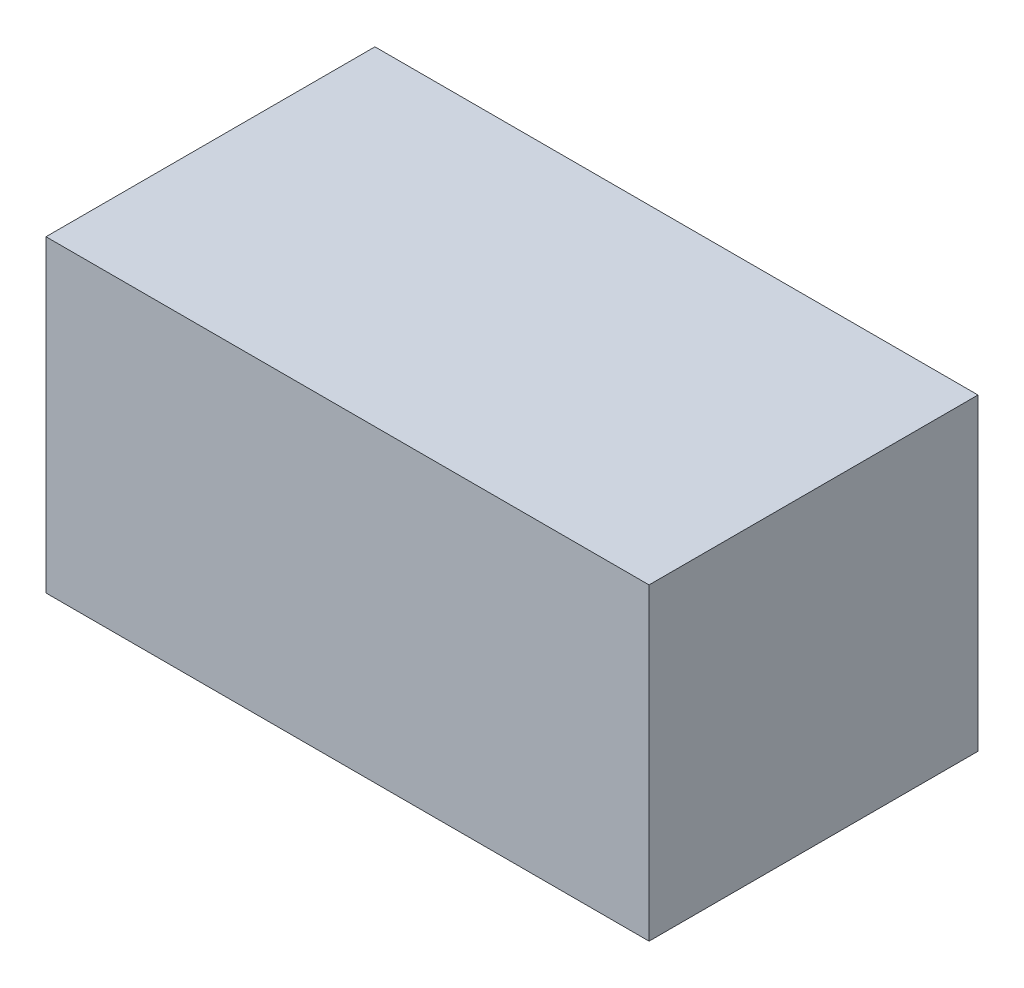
ISO-10303-21;
HEADER;
FILE_DESCRIPTION(('STEP AP214'),'2;1');
FILE_NAME('part.step','',(''),(''),'','','');
FILE_SCHEMA(('AUTOMOTIVE_DESIGN { 1 0 10303 214 1 1 1 1 }'));
ENDSEC;
DATA;
#1=APPLICATION_CONTEXT('core data for automotive mechanical design processes');
#2=APPLICATION_PROTOCOL_DEFINITION('international standard','automotive_design',2000,#1);
#3=PRODUCT_CONTEXT('',#1,'mechanical');
#4=PRODUCT('Part','Part','',(#3));
#5=PRODUCT_RELATED_PRODUCT_CATEGORY('part','',(#4));
#6=PRODUCT_DEFINITION_FORMATION('','',#4);
#7=PRODUCT_DEFINITION_CONTEXT('part definition',#1,'design');
#8=PRODUCT_DEFINITION('design','',#6,#7);
#9=PRODUCT_DEFINITION_SHAPE('','',#8);
#10=(LENGTH_UNIT() NAMED_UNIT(*) SI_UNIT(.MILLI.,.METRE.));
#11=(NAMED_UNIT(*) PLANE_ANGLE_UNIT() SI_UNIT($,.RADIAN.));
#12=(NAMED_UNIT(*) SI_UNIT($,.STERADIAN.) SOLID_ANGLE_UNIT());
#13=UNCERTAINTY_MEASURE_WITH_UNIT(LENGTH_MEASURE(1.E-05),#10,'distance_accuracy_value','');
#14=(GEOMETRIC_REPRESENTATION_CONTEXT(3) GLOBAL_UNCERTAINTY_ASSIGNED_CONTEXT((#13)) GLOBAL_UNIT_ASSIGNED_CONTEXT((#10,
#11,#12)) REPRESENTATION_CONTEXT('',''));
#15=CARTESIAN_POINT('',(0.,0.,0.));
#16=DIRECTION('',(0.,0.,1.));
#17=DIRECTION('',(1.,0.,0.));
#18=AXIS2_PLACEMENT_3D('',#15,#16,#17);
#19=CARTESIAN_POINT('',(-55.,0.,30.));
#20=DIRECTION('',(1.,0.,0.));
#21=DIRECTION('',(0.,0.,-1.));
#22=AXIS2_PLACEMENT_3D('',#19,#20,#21);
#23=PLANE('',#22);
#24=DIRECTION('',(0.,-1.,0.));
#25=VECTOR('',#24,1.);
#26=CARTESIAN_POINT('',(-55.,0.,-30.));
#27=LINE('',#26,#25);
#28=CARTESIAN_POINT('',(-55.,56.283128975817,-30.));
#29=VERTEX_POINT('',#28);
#30=CARTESIAN_POINT('',(-55.,0.,-30.));
#31=VERTEX_POINT('',#30);
#32=EDGE_CURVE('E95',#29,#31,#27,.T.);
#33=ORIENTED_EDGE('',*,*,#32,.T.);
#34=DIRECTION('',(0.,0.,-1.));
#35=VECTOR('',#34,1.);
#36=CARTESIAN_POINT('',(-55.,0.,30.));
#37=LINE('',#36,#35);
#38=CARTESIAN_POINT('',(-55.,0.,30.));
#39=VERTEX_POINT('',#38);
#40=EDGE_CURVE('E11',#39,#31,#37,.T.);
#41=ORIENTED_EDGE('',*,*,#40,.F.);
#42=DIRECTION('',(0.,-1.,0.));
#43=VECTOR('',#42,1.);
#44=CARTESIAN_POINT('',(-55.,0.,30.));
#45=LINE('',#44,#43);
#46=CARTESIAN_POINT('',(-55.,56.283128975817,30.));
#47=VERTEX_POINT('',#46);
#48=EDGE_CURVE('E83',#47,#39,#45,.T.);
#49=ORIENTED_EDGE('',*,*,#48,.F.);
#50=DIRECTION('',(0.,0.,-1.));
#51=VECTOR('',#50,1.);
#52=CARTESIAN_POINT('',(-55.,56.283128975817,30.));
#53=LINE('',#52,#51);
#54=EDGE_CURVE('E91',#47,#29,#53,.T.);
#55=ORIENTED_EDGE('',*,*,#54,.T.);
#56=EDGE_LOOP('',(#33,#41,#49,#55));
#57=FACE_BOUND('',#56,.T.);
#58=ADVANCED_FACE('F32',(#57),#23,.F.);
#59=CARTESIAN_POINT('',(55.,0.,30.));
#60=DIRECTION('',(0.,1.,0.));
#61=DIRECTION('',(0.,0.,1.));
#62=AXIS2_PLACEMENT_3D('',#59,#60,#61);
#63=PLANE('',#62);
#64=DIRECTION('',(1.,0.,0.));
#65=VECTOR('',#64,1.);
#66=CARTESIAN_POINT('',(55.,0.,-30.));
#67=LINE('',#66,#65);
#68=CARTESIAN_POINT('',(55.,0.,-30.));
#69=VERTEX_POINT('',#68);
#70=EDGE_CURVE('E87',#31,#69,#67,.T.);
#71=ORIENTED_EDGE('',*,*,#70,.T.);
#72=DIRECTION('',(0.,0.,-1.));
#73=VECTOR('',#72,1.);
#74=CARTESIAN_POINT('',(55.,0.,30.));
#75=LINE('',#74,#73);
#76=CARTESIAN_POINT('',(55.,0.,30.));
#77=VERTEX_POINT('',#76);
#78=EDGE_CURVE('E40',#77,#69,#75,.T.);
#79=ORIENTED_EDGE('',*,*,#78,.F.);
#80=DIRECTION('',(1.,0.,0.));
#81=VECTOR('',#80,1.);
#82=CARTESIAN_POINT('',(55.,0.,30.));
#83=LINE('',#82,#81);
#84=EDGE_CURVE('E78',#39,#77,#83,.T.);
#85=ORIENTED_EDGE('',*,*,#84,.F.);
#86=ORIENTED_EDGE('',*,*,#40,.T.);
#87=EDGE_LOOP('',(#71,#79,#85,#86));
#88=FACE_BOUND('',#87,.T.);
#89=ADVANCED_FACE('F86',(#88),#63,.F.);
#90=CARTESIAN_POINT('',(55.,0.,30.));
#91=DIRECTION('',(-1.,0.,0.));
#92=DIRECTION('',(0.,0.,1.));
#93=AXIS2_PLACEMENT_3D('',#90,#91,#92);
#94=PLANE('',#93);
#95=DIRECTION('',(0.,1.,0.));
#96=VECTOR('',#95,1.);
#97=CARTESIAN_POINT('',(55.,0.,-30.));
#98=LINE('',#97,#96);
#99=CARTESIAN_POINT('',(55.,56.283128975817,-30.));
#100=VERTEX_POINT('',#99);
#101=EDGE_CURVE('E65',#69,#100,#98,.T.);
#102=ORIENTED_EDGE('',*,*,#101,.T.);
#103=DIRECTION('',(0.,0.,-1.));
#104=VECTOR('',#103,1.);
#105=CARTESIAN_POINT('',(55.,56.283128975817,30.));
#106=LINE('',#105,#104);
#107=CARTESIAN_POINT('',(55.,56.283128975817,30.));
#108=VERTEX_POINT('',#107);
#109=EDGE_CURVE('E88',#108,#100,#106,.T.);
#110=ORIENTED_EDGE('',*,*,#109,.F.);
#111=DIRECTION('',(0.,1.,0.));
#112=VECTOR('',#111,1.);
#113=CARTESIAN_POINT('',(55.,0.,30.));
#114=LINE('',#113,#112);
#115=EDGE_CURVE('E81',#77,#108,#114,.T.);
#116=ORIENTED_EDGE('',*,*,#115,.F.);
#117=ORIENTED_EDGE('',*,*,#78,.T.);
#118=EDGE_LOOP('',(#102,#110,#116,#117));
#119=FACE_BOUND('',#118,.T.);
#120=ADVANCED_FACE('F89',(#119),#94,.F.);
#121=CARTESIAN_POINT('',(-55.,56.283128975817,30.));
#122=DIRECTION('',(0.,-1.,0.));
#123=DIRECTION('',(0.,0.,-1.));
#124=AXIS2_PLACEMENT_3D('',#121,#122,#123);
#125=PLANE('',#124);
#126=DIRECTION('',(-1.,0.,0.));
#127=VECTOR('',#126,1.);
#128=CARTESIAN_POINT('',(-55.,56.283128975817,-30.));
#129=LINE('',#128,#127);
#130=EDGE_CURVE('E71',#100,#29,#129,.T.);
#131=ORIENTED_EDGE('',*,*,#130,.T.);
#132=ORIENTED_EDGE('',*,*,#54,.F.);
#133=DIRECTION('',(-1.,0.,0.));
#134=VECTOR('',#133,1.);
#135=CARTESIAN_POINT('',(-55.,56.283128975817,30.));
#136=LINE('',#135,#134);
#137=EDGE_CURVE('E48',#108,#47,#136,.T.);
#138=ORIENTED_EDGE('',*,*,#137,.F.);
#139=ORIENTED_EDGE('',*,*,#109,.T.);
#140=EDGE_LOOP('',(#131,#132,#138,#139));
#141=FACE_BOUND('',#140,.T.);
#142=ADVANCED_FACE('F102',(#141),#125,.F.);
#143=CARTESIAN_POINT('',(-55.,56.283128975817,30.));
#144=DIRECTION('',(0.,0.,-1.));
#145=DIRECTION('',(-1.,0.,0.));
#146=AXIS2_PLACEMENT_3D('',#143,#144,#145);
#147=PLANE('',#146);
#148=ORIENTED_EDGE('',*,*,#48,.T.);
#149=ORIENTED_EDGE('',*,*,#84,.T.);
#150=ORIENTED_EDGE('',*,*,#115,.T.);
#151=ORIENTED_EDGE('',*,*,#137,.T.);
#152=EDGE_LOOP('',(#148,#149,#150,#151));
#153=FACE_BOUND('',#152,.T.);
#154=ADVANCED_FACE('F79',(#153),#147,.F.);
#155=CARTESIAN_POINT('',(-55.,56.283128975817,-30.));
#156=DIRECTION('',(0.,0.,-1.));
#157=DIRECTION('',(-1.,0.,0.));
#158=AXIS2_PLACEMENT_3D('',#155,#156,#157);
#159=PLANE('',#158);
#160=ORIENTED_EDGE('',*,*,#32,.F.);
#161=ORIENTED_EDGE('',*,*,#130,.F.);
#162=ORIENTED_EDGE('',*,*,#101,.F.);
#163=ORIENTED_EDGE('',*,*,#70,.F.);
#164=EDGE_LOOP('',(#160,#161,#162,#163));
#165=FACE_BOUND('',#164,.T.);
#166=ADVANCED_FACE('F105',(#165),#159,.T.);
#167=CLOSED_SHELL('',(#58,#89,#120,#142,#154,#166));
#168=MANIFOLD_SOLID_BREP('B2',#167);
#169=ADVANCED_BREP_SHAPE_REPRESENTATION('',(#18,#168),#14);
#170=SHAPE_DEFINITION_REPRESENTATION(#9,#169);
ENDSEC;
END-ISO-10303-21;
